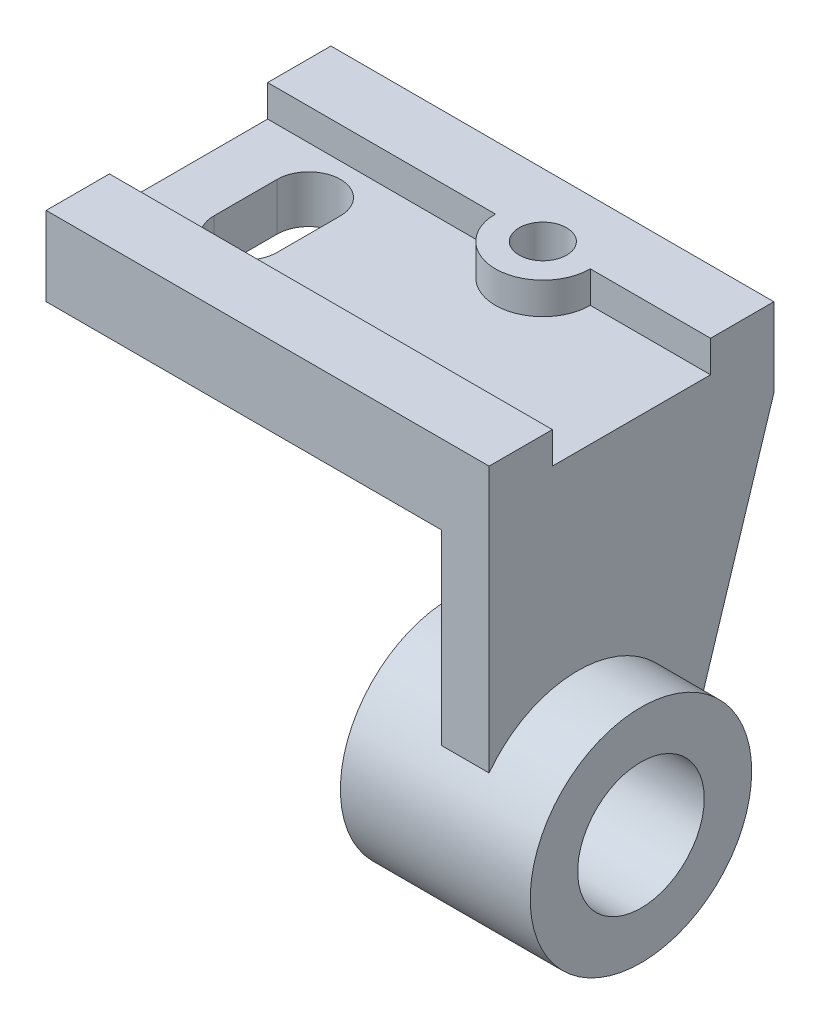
from build123d import *

# Parameters (mm, degrees)
SKETCH_1_W          = 140
SKETCH_1_H          = 90
EXTRUDE_1_DEPTH     = 25
CUT_EXTRUDE_1_DEPTH = 10
SKETCH_3_R          = 7.5
CUT_EXTRUDE_2_DEPTH = 169.300326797
CUT_EXTRUDE_3_DEPTH = 168.107749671
SKETCH_5_R          = 35
SKETCH_5_R_2        = 20
EXTRUDE_2_DEPTH     = 60
EXTRUDE_3_DEPTH     = 15


with BuildPart() as part:
    # Sketch 1 → Extrude 1 (new body)
    with BuildSketch(Plane(origin=(0, 0, 0), x_dir=(1, 0, 0), z_dir=(0, 1, 0))):
        with Locations((-70, -45)):
            Rectangle(SKETCH_1_W, SKETCH_1_H)
    extrude(amount=EXTRUDE_1_DEPTH)

    # Sketch 2 → Cut-Extrude 1 (cut)
    with BuildSketch(Plane(origin=(0, 25, 0), x_dir=(1, 0, 0), z_dir=(0, 1, 0))):
        with BuildLine():
            Line((-140, -20), (-68, -20))
            ThreePointArc((-68, -20), (-53, -35), (-38, -20))
            Line((-38, -20), (0, -20))
            Line((0, -20), (0, -70))
            Line((0, -70), (-140, -70))
            Line((-140, -70), (-140, -20))
        make_face()
    extrude(amount=-CUT_EXTRUDE_1_DEPTH, mode=Mode.SUBTRACT)

    # Sketch 3 → Cut-Extrude 2 (cut, through all)
    with BuildSketch(Plane(origin=(0, 25, 0), x_dir=(1, 0, 0), z_dir=(0, 1, 0))):
        with Locations(Location((-53, -20, 0), (0, 0, 270))):
            Circle(SKETCH_3_R)
    extrude(amount=-CUT_EXTRUDE_2_DEPTH, mode=Mode.SUBTRACT)

    # Sketch 4 → Cut-Extrude 3 (cut, through all)
    with BuildSketch(Plane(origin=(0, 15, 0), x_dir=(1, 0, 0), z_dir=(0, 1, 0))):
        with BuildLine():
            Line((-122, -35), (-122, -55))
            ThreePointArc((-122, -55), (-112, -65), (-102, -55))
            Line((-102, -55), (-102, -35))
            ThreePointArc((-102, -35), (-112, -25), (-122, -35))
        make_face()
    extrude(amount=-CUT_EXTRUDE_3_DEPTH, mode=Mode.SUBTRACT)



with BuildPart() as body_2:
    # Sketch 5 → Extrude 2 (new body)
    with BuildSketch(Plane(origin=(-40, 0, 0), x_dir=(0, 0, -1), z_dir=(1, 0, 0))):
        with Locations((-62, -80)):
            Circle(SKETCH_5_R)
        with Locations((-62, -80)):
            Circle(SKETCH_5_R_2, mode=Mode.SUBTRACT)
    extrude(amount=EXTRUDE_2_DEPTH)


with BuildPart() as part_1:
    add(part.part)

    add(body_2.part)  # Extrude 3 merges body 2
    # Sketch 6 → Extrude 3 (add)
    with BuildSketch(Plane(origin=(0, 0, 0), x_dir=(0, 0, -1), z_dir=(1, 0, 0))):
        with BuildLine():
            Line((0, 0), (-28.628117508, -90.550708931))
            ThreePointArc((-28.628117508, -90.550708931), (-45.997622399, -48.872457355), (-90, -59))
            Line((-90, -59), (-90, 0))
            Line((-90, 0), (0, 0))
        make_face()
    extrude(amount=-EXTRUDE_3_DEPTH)


solid = part_1.part
